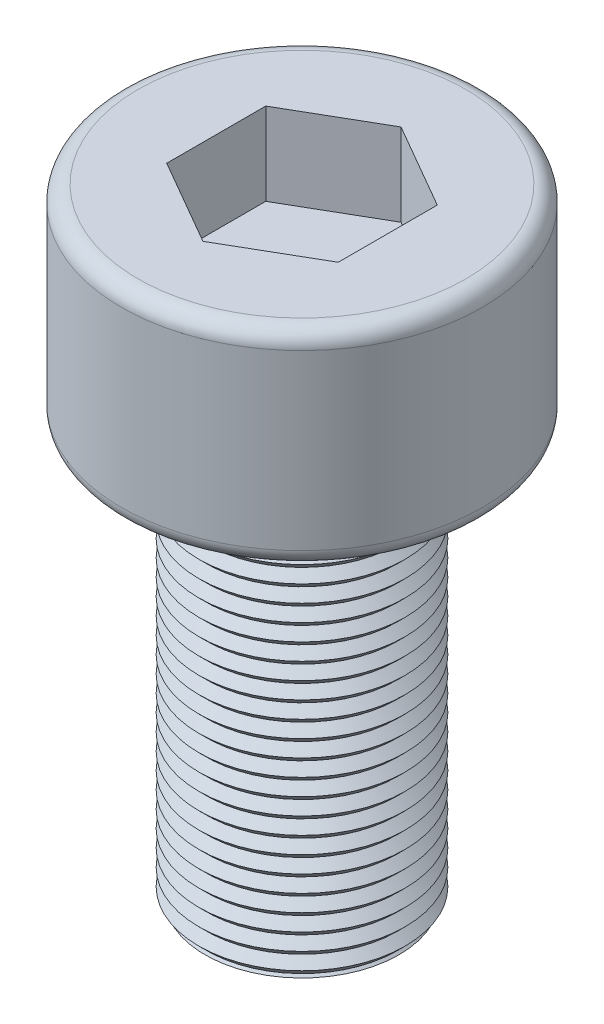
from build123d import *

# Parameters (mm, degrees)
CUT_EXTRUDE1_DEPTH = 1.27
FILLET1_R          = 0.254
SKETCH3_R          = 2.925614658
CUT_EXTRUDE2_DEPTH = 3.175


with BuildPart() as part:
    # Sketch1 → Revolve1 (revolve)
    with BuildSketch(Plane.XY):
        Polygon((-1.587496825, 6.3499873), (-1.458607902, 6.3499873), (-1.458607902, 6.221098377), (-1.587496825, 6.092209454), (-1.458607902, 5.963320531), (-1.587496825, 5.834431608), (-1.458607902, 5.705542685), (-1.587496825, 5.576653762), (-1.458607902, 5.447764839), (-1.587496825, 5.318875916), (-1.458607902, 5.189986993), (-1.587496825, 5.06109807), (-1.458607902, 4.932209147), (-1.587496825, 4.803320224), (-1.458607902, 4.674431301), (-1.587496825, 4.545542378), (-1.458607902, 4.416653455), (-1.587496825, 4.287764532), (-1.458607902, 4.158875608), (-1.587496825, 4.029986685), (-1.458607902, 3.901097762), (-1.587496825, 3.772208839), (-1.458607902, 3.643319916), (-1.587496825, 3.514430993), (-1.458607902, 3.38554207), (-1.587496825, 3.256653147), (-1.458607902, 3.127764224), (-1.587496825, 2.998875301), (-1.458607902, 2.869986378), (-1.587496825, 2.741097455), (-1.458607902, 2.612208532), (-1.587496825, 2.483319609), (-1.458607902, 2.354430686), (-1.587496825, 2.225541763), (-1.458607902, 2.09665284), (-1.587496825, 1.967763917), (-1.458607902, 1.838874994), (-1.587496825, 1.709986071), (-1.458607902, 1.581097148), (-1.587496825, 1.452208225), (-1.458607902, 1.323319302), (-1.587496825, 1.194430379), (-1.458607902, 1.065541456), (-1.587496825, 0.936652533), (-1.458607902, 0.80776361), (-1.587496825, 0.678874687), (-1.458607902, 0.549985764), (-1.587496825, 0.421096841), (-1.458607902, 0.292207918), (-1.587496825, 0.163318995), (-1.458607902, 0.034430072), (-1.587496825, -0.094458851), (-1.458607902, -0.223347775), (-1.587496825, -0.352236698), (-1.458607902, -0.481125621), (-1.587496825, -0.610014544), (-1.458607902, -0.738903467), (-1.587496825, -0.86779239), (-1.458607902, -0.996681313), (-1.587496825, -1.125570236), (-1.458607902, -1.254459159), (-1.587496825, -1.383348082), (-1.458607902, -1.512237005), (-1.587496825, -1.641125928), (-1.458607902, -1.770014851), (-1.587496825, -1.898903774), (-1.458607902, -2.027792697), (-1.587496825, -2.15668162), (-1.458607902, -2.285570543), (-1.587496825, -2.414459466), (-1.458607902, -2.543348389), (-1.587496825, -2.672237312), (-1.458607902, -2.801126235), (-1.587496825, -2.930015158), (-1.458607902, -3.058904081), (-1.574716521, -3.1750127), (0, -3.1750127), (0, 0), (0, 9.52498095), (-2.778119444, 9.52498095), (-2.778119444, 6.3499873), align=None)
    revolve(axis=Axis((0, 9.52498095, 0), (0, -1, 0)))

    # Sketch2 → Cut-Extrude1 (cut)
    with BuildSketch(Plane(origin=(0, 9.52498095, 0), x_dir=(1, 0, 0), z_dir=(0, 1, 0))):
        Polygon((0, 1.524), (-1.319822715, 0.762), (-1.319822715, -0.762), (0, -1.524), (1.319822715, -0.762), (1.319822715, 0.762), align=None)
    extrude(amount=-CUT_EXTRUDE1_DEPTH, mode=Mode.SUBTRACT)

    # Fillet1
    fillet1_edges = [part.edges().sort_by_distance(p)[0] for p in [
        (2.778119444, 6.3499873, 0),
        (2.778119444, 9.52498095, 0),
    ]]
    fillet(fillet1_edges, radius=FILLET1_R)

    # Sketch3 → Cut-Extrude2 (cut)
    with BuildSketch(Plane.XZ.offset(3.1750127)):
        Circle(SKETCH3_R)
    extrude(amount=-CUT_EXTRUDE2_DEPTH, mode=Mode.SUBTRACT)


solid = part.part
